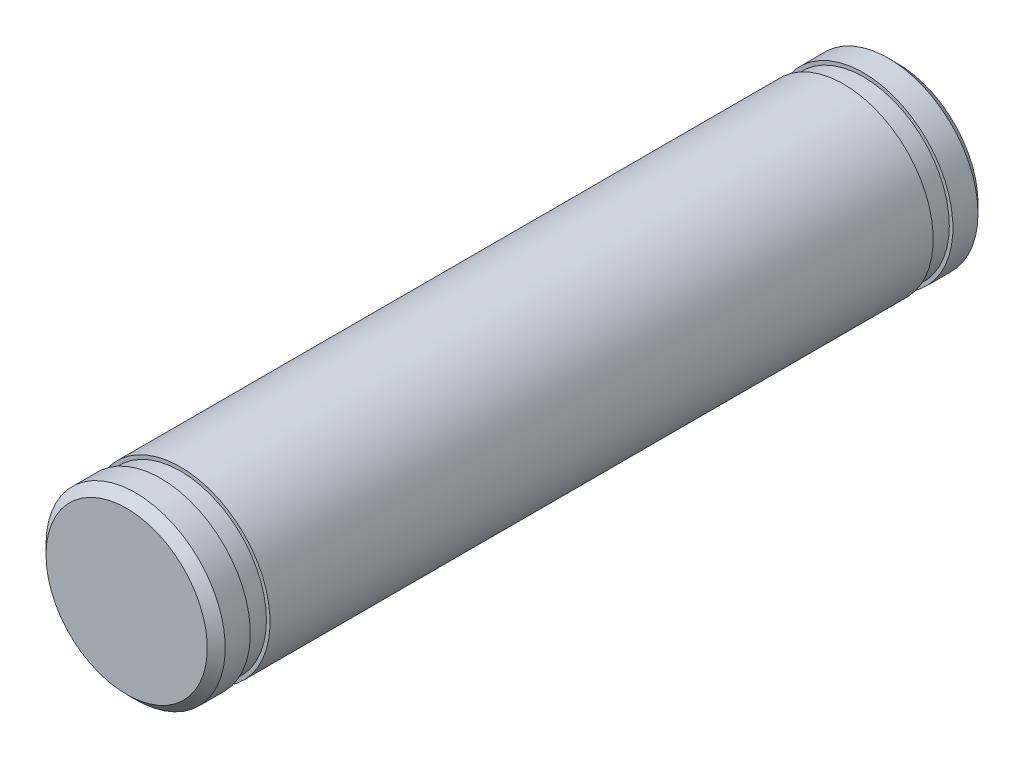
ISO-10303-21;
HEADER;
FILE_DESCRIPTION(('STEP AP214'),'2;1');
FILE_NAME('part.step','',(''),(''),'','','');
FILE_SCHEMA(('AUTOMOTIVE_DESIGN { 1 0 10303 214 1 1 1 1 }'));
ENDSEC;
DATA;
#1=APPLICATION_CONTEXT('core data for automotive mechanical design processes');
#2=APPLICATION_PROTOCOL_DEFINITION('international standard','automotive_design',2000,#1);
#3=PRODUCT_CONTEXT('',#1,'mechanical');
#4=PRODUCT('Part','Part','',(#3));
#5=PRODUCT_RELATED_PRODUCT_CATEGORY('part','',(#4));
#6=PRODUCT_DEFINITION_FORMATION('','',#4);
#7=PRODUCT_DEFINITION_CONTEXT('part definition',#1,'design');
#8=PRODUCT_DEFINITION('design','',#6,#7);
#9=PRODUCT_DEFINITION_SHAPE('','',#8);
#10=(LENGTH_UNIT() NAMED_UNIT(*) SI_UNIT(.MILLI.,.METRE.));
#11=(NAMED_UNIT(*) PLANE_ANGLE_UNIT() SI_UNIT($,.RADIAN.));
#12=(NAMED_UNIT(*) SI_UNIT($,.STERADIAN.) SOLID_ANGLE_UNIT());
#13=UNCERTAINTY_MEASURE_WITH_UNIT(LENGTH_MEASURE(1.E-05),#10,'distance_accuracy_value','');
#14=(GEOMETRIC_REPRESENTATION_CONTEXT(3) GLOBAL_UNCERTAINTY_ASSIGNED_CONTEXT((#13)) GLOBAL_UNIT_ASSIGNED_CONTEXT((#10,
#11,#12)) REPRESENTATION_CONTEXT('',''));
#15=CARTESIAN_POINT('',(0.,0.,0.));
#16=DIRECTION('',(0.,0.,1.));
#17=DIRECTION('',(1.,0.,0.));
#18=AXIS2_PLACEMENT_3D('',#15,#16,#17);
#19=CARTESIAN_POINT('',(0.,0.,21.5));
#20=DIRECTION('',(0.,0.,1.));
#21=DIRECTION('',(1.,0.,0.));
#22=AXIS2_PLACEMENT_3D('',#19,#20,#21);
#23=PLANE('',#22);
#24=CARTESIAN_POINT('',(0.,0.,21.5000000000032));
#25=DIRECTION('',(0.,0.,-1.));
#26=DIRECTION('',(-1.,0.,0.));
#27=AXIS2_PLACEMENT_3D('',#24,#25,#26);
#28=CIRCLE('',#27,4.50000000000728);
#29=CARTESIAN_POINT('',(-4.50000000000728,0.,21.5000000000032));
#30=VERTEX_POINT('',#29);
#31=EDGE_CURVE('E18',#30,#30,#28,.T.);
#32=ORIENTED_EDGE('',*,*,#31,.F.);
#33=EDGE_LOOP('',(#32));
#34=FACE_BOUND('',#33,.T.);
#35=ADVANCED_FACE('F15',(#34),#23,.T.);
#36=CARTESIAN_POINT('',(0.,0.,-21.5));
#37=DIRECTION('',(0.,0.,1.));
#38=DIRECTION('',(1.,0.,0.));
#39=AXIS2_PLACEMENT_3D('',#36,#37,#38);
#40=PLANE('',#39);
#41=CARTESIAN_POINT('',(0.,0.,-21.4999999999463));
#42=DIRECTION('',(0.,0.,1.));
#43=DIRECTION('',(1.,0.,0.));
#44=AXIS2_PLACEMENT_3D('',#41,#42,#43);
#45=CIRCLE('',#44,4.50000000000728);
#46=CARTESIAN_POINT('',(4.50000000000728,0.,-21.4999999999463));
#47=VERTEX_POINT('',#46);
#48=EDGE_CURVE('E50',#47,#47,#45,.T.);
#49=ORIENTED_EDGE('',*,*,#48,.F.);
#50=EDGE_LOOP('',(#49));
#51=FACE_BOUND('',#50,.T.);
#52=ADVANCED_FACE('F62',(#51),#40,.F.);
#53=CARTESIAN_POINT('',(0.,0.,21.000000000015));
#54=DIRECTION('',(0.,0.,-1.));
#55=DIRECTION('',(-1.,0.,0.));
#56=AXIS2_PLACEMENT_3D('',#53,#54,#55);
#57=CONICAL_SURFACE('',#56,4.99999999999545,0.785398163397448);
#58=ORIENTED_EDGE('',*,*,#31,.T.);
#59=EDGE_LOOP('',(#58));
#60=FACE_BOUND('',#59,.T.);
#61=CARTESIAN_POINT('',(0.,0.,21.));
#62=DIRECTION('',(0.,0.,-1.));
#63=DIRECTION('',(-1.,0.,0.));
#64=AXIS2_PLACEMENT_3D('',#61,#62,#63);
#65=CIRCLE('',#64,5.);
#66=CARTESIAN_POINT('',(-5.,0.,21.));
#67=VERTEX_POINT('',#66);
#68=EDGE_CURVE('E30',#67,#67,#65,.T.);
#69=ORIENTED_EDGE('',*,*,#68,.F.);
#70=EDGE_LOOP('',(#69));
#71=FACE_BOUND('',#70,.T.);
#72=ADVANCED_FACE('F58',(#60,#71),#57,.T.);
#73=CARTESIAN_POINT('',(0.,0.,-21.000000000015));
#74=DIRECTION('',(0.,0.,1.));
#75=DIRECTION('',(1.,0.,0.));
#76=AXIS2_PLACEMENT_3D('',#73,#74,#75);
#77=CONICAL_SURFACE('',#76,4.99999999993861,0.785398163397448);
#78=ORIENTED_EDGE('',*,*,#48,.T.);
#79=EDGE_LOOP('',(#78));
#80=FACE_BOUND('',#79,.T.);
#81=CARTESIAN_POINT('',(0.,0.,-21.));
#82=DIRECTION('',(0.,0.,-1.));
#83=DIRECTION('',(-1.,0.,0.));
#84=AXIS2_PLACEMENT_3D('',#81,#82,#83);
#85=CIRCLE('',#84,5.);
#86=CARTESIAN_POINT('',(-5.,0.,-21.));
#87=VERTEX_POINT('',#86);
#88=EDGE_CURVE('E49',#87,#87,#85,.F.);
#89=ORIENTED_EDGE('',*,*,#88,.F.);
#90=EDGE_LOOP('',(#89));
#91=FACE_BOUND('',#90,.T.);
#92=ADVANCED_FACE('F106',(#80,#91),#77,.T.);
#93=CARTESIAN_POINT('',(0.,0.,21.5));
#94=DIRECTION('',(0.,0.,-1.));
#95=DIRECTION('',(-1.,0.,0.));
#96=AXIS2_PLACEMENT_3D('',#93,#94,#95);
#97=CYLINDRICAL_SURFACE('',#96,5.);
#98=ORIENTED_EDGE('',*,*,#68,.T.);
#99=EDGE_LOOP('',(#98));
#100=FACE_BOUND('',#99,.T.);
#101=CARTESIAN_POINT('',(0.,0.,19.6));
#102=DIRECTION('',(0.,0.,-1.));
#103=DIRECTION('',(-1.,0.,0.));
#104=AXIS2_PLACEMENT_3D('',#101,#102,#103);
#105=CIRCLE('',#104,5.);
#106=CARTESIAN_POINT('',(-5.,0.,19.6));
#107=VERTEX_POINT('',#106);
#108=EDGE_CURVE('E47',#107,#107,#105,.T.);
#109=ORIENTED_EDGE('',*,*,#108,.F.);
#110=EDGE_LOOP('',(#109));
#111=FACE_BOUND('',#110,.T.);
#112=ADVANCED_FACE('F102',(#100,#111),#97,.T.);
#113=CARTESIAN_POINT('',(0.,0.,21.5));
#114=DIRECTION('',(0.,0.,-1.));
#115=DIRECTION('',(-1.,0.,0.));
#116=AXIS2_PLACEMENT_3D('',#113,#114,#115);
#117=CYLINDRICAL_SURFACE('',#116,5.);
#118=CARTESIAN_POINT('',(0.,0.,-19.6));
#119=DIRECTION('',(0.,0.,-1.));
#120=DIRECTION('',(-1.,0.,0.));
#121=AXIS2_PLACEMENT_3D('',#118,#119,#120);
#122=CIRCLE('',#121,5.);
#123=CARTESIAN_POINT('',(-5.,0.,-19.6));
#124=VERTEX_POINT('',#123);
#125=EDGE_CURVE('E44',#124,#124,#122,.F.);
#126=ORIENTED_EDGE('',*,*,#125,.F.);
#127=EDGE_LOOP('',(#126));
#128=FACE_BOUND('',#127,.T.);
#129=ORIENTED_EDGE('',*,*,#88,.T.);
#130=EDGE_LOOP('',(#129));
#131=FACE_BOUND('',#130,.T.);
#132=ADVANCED_FACE('F98',(#128,#131),#117,.T.);
#133=CARTESIAN_POINT('',(5.,0.,19.6));
#134=DIRECTION('',(0.,0.,-1.));
#135=DIRECTION('',(-1.,0.,0.));
#136=AXIS2_PLACEMENT_3D('',#133,#134,#135);
#137=PLANE('',#136);
#138=ORIENTED_EDGE('',*,*,#108,.T.);
#139=EDGE_LOOP('',(#138));
#140=FACE_BOUND('',#139,.T.);
#141=CARTESIAN_POINT('',(0.,0.,19.6));
#142=DIRECTION('',(0.,0.,1.));
#143=DIRECTION('',(1.,0.,0.));
#144=AXIS2_PLACEMENT_3D('',#141,#142,#143);
#145=CIRCLE('',#144,4.8);
#146=CARTESIAN_POINT('',(4.8,0.,19.6));
#147=VERTEX_POINT('',#146);
#148=EDGE_CURVE('E41',#147,#147,#145,.F.);
#149=ORIENTED_EDGE('',*,*,#148,.F.);
#150=EDGE_LOOP('',(#149));
#151=FACE_BOUND('',#150,.T.);
#152=ADVANCED_FACE('F94',(#140,#151),#137,.T.);
#153=CARTESIAN_POINT('',(5.,0.,-19.6));
#154=DIRECTION('',(0.,0.,1.));
#155=DIRECTION('',(1.,0.,0.));
#156=AXIS2_PLACEMENT_3D('',#153,#154,#155);
#157=PLANE('',#156);
#158=ORIENTED_EDGE('',*,*,#125,.T.);
#159=EDGE_LOOP('',(#158));
#160=FACE_BOUND('',#159,.T.);
#161=CARTESIAN_POINT('',(0.,0.,-19.6));
#162=DIRECTION('',(0.,0.,-1.));
#163=DIRECTION('',(-1.,0.,0.));
#164=AXIS2_PLACEMENT_3D('',#161,#162,#163);
#165=CIRCLE('',#164,4.8);
#166=CARTESIAN_POINT('',(-4.8,0.,-19.6));
#167=VERTEX_POINT('',#166);
#168=EDGE_CURVE('E38',#167,#167,#165,.F.);
#169=ORIENTED_EDGE('',*,*,#168,.F.);
#170=EDGE_LOOP('',(#169));
#171=FACE_BOUND('',#170,.T.);
#172=ADVANCED_FACE('F90',(#160,#171),#157,.T.);
#173=CARTESIAN_POINT('',(0.,0.,21.5));
#174=DIRECTION('',(0.,0.,1.));
#175=DIRECTION('',(1.,0.,0.));
#176=AXIS2_PLACEMENT_3D('',#173,#174,#175);
#177=CYLINDRICAL_SURFACE('',#176,4.8);
#178=ORIENTED_EDGE('',*,*,#148,.T.);
#179=EDGE_LOOP('',(#178));
#180=FACE_BOUND('',#179,.T.);
#181=CARTESIAN_POINT('',(0.,0.,18.5));
#182=DIRECTION('',(0.,0.,1.));
#183=DIRECTION('',(1.,0.,0.));
#184=AXIS2_PLACEMENT_3D('',#181,#182,#183);
#185=CIRCLE('',#184,4.8);
#186=CARTESIAN_POINT('',(4.8,0.,18.5));
#187=VERTEX_POINT('',#186);
#188=EDGE_CURVE('E35',#187,#187,#185,.F.);
#189=ORIENTED_EDGE('',*,*,#188,.F.);
#190=EDGE_LOOP('',(#189));
#191=FACE_BOUND('',#190,.T.);
#192=ADVANCED_FACE('F86',(#180,#191),#177,.T.);
#193=CARTESIAN_POINT('',(0.,0.,-21.5));
#194=DIRECTION('',(0.,0.,-1.));
#195=DIRECTION('',(-1.,0.,0.));
#196=AXIS2_PLACEMENT_3D('',#193,#194,#195);
#197=CYLINDRICAL_SURFACE('',#196,4.8);
#198=CARTESIAN_POINT('',(0.,0.,-18.5));
#199=DIRECTION('',(0.,0.,-1.));
#200=DIRECTION('',(-1.,0.,0.));
#201=AXIS2_PLACEMENT_3D('',#198,#199,#200);
#202=CIRCLE('',#201,4.8);
#203=CARTESIAN_POINT('',(-4.8,0.,-18.5));
#204=VERTEX_POINT('',#203);
#205=EDGE_CURVE('E27',#204,#204,#202,.F.);
#206=ORIENTED_EDGE('',*,*,#205,.F.);
#207=EDGE_LOOP('',(#206));
#208=FACE_BOUND('',#207,.T.);
#209=ORIENTED_EDGE('',*,*,#168,.T.);
#210=EDGE_LOOP('',(#209));
#211=FACE_BOUND('',#210,.T.);
#212=ADVANCED_FACE('F82',(#208,#211),#197,.T.);
#213=CARTESIAN_POINT('',(5.,0.,18.5));
#214=DIRECTION('',(0.,0.,1.));
#215=DIRECTION('',(1.,0.,0.));
#216=AXIS2_PLACEMENT_3D('',#213,#214,#215);
#217=PLANE('',#216);
#218=ORIENTED_EDGE('',*,*,#188,.T.);
#219=EDGE_LOOP('',(#218));
#220=FACE_BOUND('',#219,.T.);
#221=CARTESIAN_POINT('',(0.,0.,18.5));
#222=DIRECTION('',(0.,0.,-1.));
#223=DIRECTION('',(-1.,0.,0.));
#224=AXIS2_PLACEMENT_3D('',#221,#222,#223);
#225=CIRCLE('',#224,5.);
#226=CARTESIAN_POINT('',(-5.,0.,18.5));
#227=VERTEX_POINT('',#226);
#228=EDGE_CURVE('E22',#227,#227,#225,.T.);
#229=ORIENTED_EDGE('',*,*,#228,.F.);
#230=EDGE_LOOP('',(#229));
#231=FACE_BOUND('',#230,.T.);
#232=ADVANCED_FACE('F75',(#220,#231),#217,.T.);
#233=CARTESIAN_POINT('',(5.,0.,-18.5));
#234=DIRECTION('',(0.,0.,-1.));
#235=DIRECTION('',(-1.,0.,0.));
#236=AXIS2_PLACEMENT_3D('',#233,#234,#235);
#237=PLANE('',#236);
#238=ORIENTED_EDGE('',*,*,#205,.T.);
#239=EDGE_LOOP('',(#238));
#240=FACE_BOUND('',#239,.T.);
#241=CARTESIAN_POINT('',(0.,0.,-18.5));
#242=DIRECTION('',(0.,0.,-1.));
#243=DIRECTION('',(-1.,0.,0.));
#244=AXIS2_PLACEMENT_3D('',#241,#242,#243);
#245=CIRCLE('',#244,5.);
#246=CARTESIAN_POINT('',(-5.,0.,-18.5));
#247=VERTEX_POINT('',#246);
#248=EDGE_CURVE('E10',#247,#247,#245,.F.);
#249=ORIENTED_EDGE('',*,*,#248,.F.);
#250=EDGE_LOOP('',(#249));
#251=FACE_BOUND('',#250,.T.);
#252=ADVANCED_FACE('F70',(#240,#251),#237,.T.);
#253=CARTESIAN_POINT('',(0.,0.,21.5));
#254=DIRECTION('',(0.,0.,-1.));
#255=DIRECTION('',(-1.,0.,0.));
#256=AXIS2_PLACEMENT_3D('',#253,#254,#255);
#257=CYLINDRICAL_SURFACE('',#256,5.);
#258=ORIENTED_EDGE('',*,*,#248,.T.);
#259=EDGE_LOOP('',(#258));
#260=FACE_BOUND('',#259,.T.);
#261=ORIENTED_EDGE('',*,*,#228,.T.);
#262=EDGE_LOOP('',(#261));
#263=FACE_BOUND('',#262,.T.);
#264=ADVANCED_FACE('F68',(#260,#263),#257,.T.);
#265=CLOSED_SHELL('',(#35,#52,#72,#92,#112,#132,#152,#172,#192,#212,#232,#252,#264));
#266=MANIFOLD_SOLID_BREP('B1',#265);
#267=ADVANCED_BREP_SHAPE_REPRESENTATION('',(#18,#266),#14);
#268=SHAPE_DEFINITION_REPRESENTATION(#9,#267);
ENDSEC;
END-ISO-10303-21;
